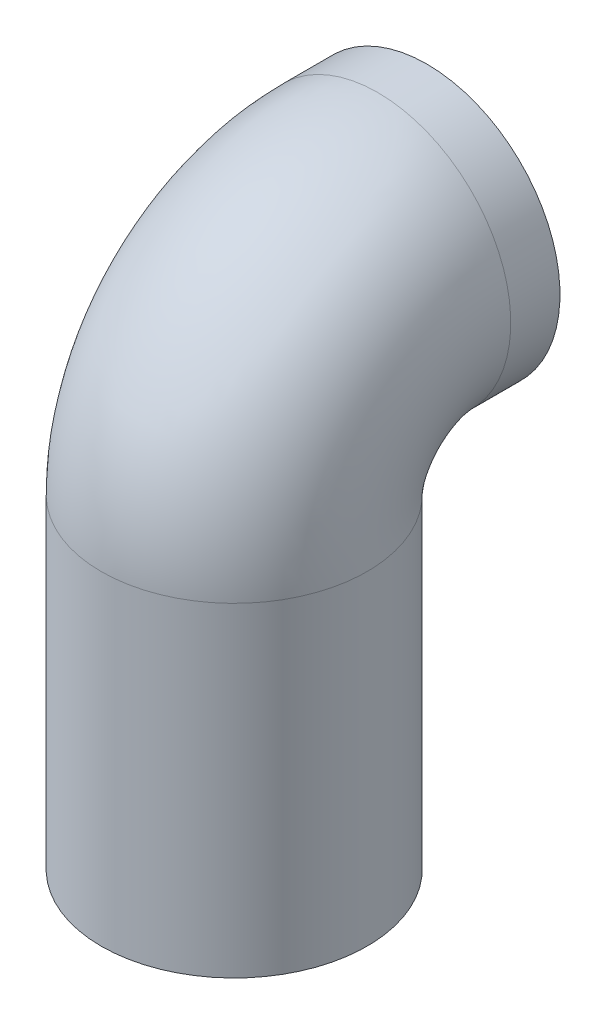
ISO-10303-21;
HEADER;
FILE_DESCRIPTION(('STEP AP214'),'2;1');
FILE_NAME('part.step','',(''),(''),'','','');
FILE_SCHEMA(('AUTOMOTIVE_DESIGN { 1 0 10303 214 1 1 1 1 }'));
ENDSEC;
DATA;
#1=APPLICATION_CONTEXT('core data for automotive mechanical design processes');
#2=APPLICATION_PROTOCOL_DEFINITION('international standard','automotive_design',2000,#1);
#3=PRODUCT_CONTEXT('',#1,'mechanical');
#4=PRODUCT('Part','Part','',(#3));
#5=PRODUCT_RELATED_PRODUCT_CATEGORY('part','',(#4));
#6=PRODUCT_DEFINITION_FORMATION('','',#4);
#7=PRODUCT_DEFINITION_CONTEXT('part definition',#1,'design');
#8=PRODUCT_DEFINITION('design','',#6,#7);
#9=PRODUCT_DEFINITION_SHAPE('','',#8);
#10=(LENGTH_UNIT() NAMED_UNIT(*) SI_UNIT(.MILLI.,.METRE.));
#11=(NAMED_UNIT(*) PLANE_ANGLE_UNIT() SI_UNIT($,.RADIAN.));
#12=(NAMED_UNIT(*) SI_UNIT($,.STERADIAN.) SOLID_ANGLE_UNIT());
#13=UNCERTAINTY_MEASURE_WITH_UNIT(LENGTH_MEASURE(1.E-05),#10,'distance_accuracy_value','');
#14=(GEOMETRIC_REPRESENTATION_CONTEXT(3) GLOBAL_UNCERTAINTY_ASSIGNED_CONTEXT((#13)) GLOBAL_UNIT_ASSIGNED_CONTEXT((#10,
#11,#12)) REPRESENTATION_CONTEXT('',''));
#15=CARTESIAN_POINT('',(0.,0.,0.));
#16=DIRECTION('',(0.,0.,1.));
#17=DIRECTION('',(1.,0.,0.));
#18=AXIS2_PLACEMENT_3D('',#15,#16,#17);
#19=CARTESIAN_POINT('',(0.,61.,0.));
#20=DIRECTION('',(0.,-1.,0.));
#21=DIRECTION('',(0.,0.,-1.));
#22=AXIS2_PLACEMENT_3D('',#19,#20,#21);
#23=CYLINDRICAL_SURFACE('',#22,25.);
#24=CARTESIAN_POINT('',(0.,61.,0.));
#25=DIRECTION('',(0.,1.,0.));
#26=DIRECTION('',(0.,0.,1.));
#27=AXIS2_PLACEMENT_3D('',#24,#25,#26);
#28=CIRCLE('',#27,25.);
#29=CARTESIAN_POINT('',(0.,61.,25.));
#30=VERTEX_POINT('',#29);
#31=EDGE_CURVE('E10',#30,#30,#28,.T.);
#32=ORIENTED_EDGE('',*,*,#31,.F.);
#33=EDGE_LOOP('',(#32));
#34=FACE_BOUND('',#33,.T.);
#35=CARTESIAN_POINT('',(0.,0.,0.));
#36=DIRECTION('',(0.,1.,0.));
#37=DIRECTION('',(0.,0.,1.));
#38=AXIS2_PLACEMENT_3D('',#35,#36,#37);
#39=CIRCLE('',#38,25.);
#40=CARTESIAN_POINT('',(0.,0.,25.));
#41=VERTEX_POINT('',#40);
#42=EDGE_CURVE('E32',#41,#41,#39,.T.);
#43=ORIENTED_EDGE('',*,*,#42,.T.);
#44=EDGE_LOOP('',(#43));
#45=FACE_BOUND('',#44,.T.);
#46=ADVANCED_FACE('F29',(#34,#45),#23,.T.);
#47=CARTESIAN_POINT('',(0.,0.,0.));
#48=DIRECTION('',(0.,1.,0.));
#49=DIRECTION('',(0.,0.,1.));
#50=AXIS2_PLACEMENT_3D('',#47,#48,#49);
#51=PLANE('',#50);
#52=ORIENTED_EDGE('',*,*,#42,.F.);
#53=EDGE_LOOP('',(#52));
#54=FACE_BOUND('',#53,.T.);
#55=ADVANCED_FACE('F57',(#54),#51,.F.);
#56=CARTESIAN_POINT('',(0.,61.,-27.));
#57=DIRECTION('',(1.,0.,0.));
#58=DIRECTION('',(0.,0.,-1.));
#59=AXIS2_PLACEMENT_3D('',#56,#57,#58);
#60=TOROIDAL_SURFACE('',#59,27.,25.);
#61=CARTESIAN_POINT('',(0.,88.,-27.));
#62=DIRECTION('',(0.,0.,-1.));
#63=DIRECTION('',(0.,1.,0.));
#64=AXIS2_PLACEMENT_3D('',#61,#62,#63);
#65=CIRCLE('',#64,25.);
#66=CARTESIAN_POINT('',(0.,113.,-27.));
#67=VERTEX_POINT('',#66);
#68=EDGE_CURVE('E39',#67,#67,#65,.T.);
#69=CARTESIAN_POINT('',(0.,61.,-27.));
#70=DIRECTION('',(1.,0.,0.));
#71=DIRECTION('',(0.,0.,-1.));
#72=AXIS2_PLACEMENT_3D('',#69,#70,#71);
#73=CIRCLE('',#72,52.);
#74=EDGE_CURVE('',#67,#30,#73,.T.);
#75=ORIENTED_EDGE('',*,*,#68,.F.);
#76=ORIENTED_EDGE('',*,*,#31,.T.);
#77=ORIENTED_EDGE('',*,*,#74,.T.);
#78=ORIENTED_EDGE('',*,*,#74,.F.);
#79=EDGE_LOOP('',(#75,#77,#76,#78));
#80=FACE_BOUND('',#79,.T.);
#81=ADVANCED_FACE('F52',(#80),#60,.T.);
#82=CARTESIAN_POINT('',(0.,88.,-36.25));
#83=DIRECTION('',(0.,0.,1.));
#84=DIRECTION('',(0.,-1.,0.));
#85=AXIS2_PLACEMENT_3D('',#82,#83,#84);
#86=CYLINDRICAL_SURFACE('',#85,25.);
#87=CARTESIAN_POINT('',(0.,88.,-36.25));
#88=DIRECTION('',(0.,0.,-1.));
#89=DIRECTION('',(0.,1.,0.));
#90=AXIS2_PLACEMENT_3D('',#87,#88,#89);
#91=CIRCLE('',#90,25.);
#92=CARTESIAN_POINT('',(0.,113.,-36.25));
#93=VERTEX_POINT('',#92);
#94=EDGE_CURVE('E43',#93,#93,#91,.T.);
#95=ORIENTED_EDGE('',*,*,#94,.F.);
#96=EDGE_LOOP('',(#95));
#97=FACE_BOUND('',#96,.T.);
#98=ORIENTED_EDGE('',*,*,#68,.T.);
#99=EDGE_LOOP('',(#98));
#100=FACE_BOUND('',#99,.T.);
#101=ADVANCED_FACE('F49',(#97,#100),#86,.T.);
#102=CARTESIAN_POINT('',(0.,88.,-36.25));
#103=DIRECTION('',(0.,0.,-1.));
#104=DIRECTION('',(0.,1.,0.));
#105=AXIS2_PLACEMENT_3D('',#102,#103,#104);
#106=PLANE('',#105);
#107=ORIENTED_EDGE('',*,*,#94,.T.);
#108=EDGE_LOOP('',(#107));
#109=FACE_BOUND('',#108,.T.);
#110=ADVANCED_FACE('F47',(#109),#106,.T.);
#111=CLOSED_SHELL('',(#46,#55,#81,#101,#110));
#112=MANIFOLD_SOLID_BREP('B2',#111);
#113=ADVANCED_BREP_SHAPE_REPRESENTATION('',(#18,#112),#14);
#114=SHAPE_DEFINITION_REPRESENTATION(#9,#113);
ENDSEC;
END-ISO-10303-21;
